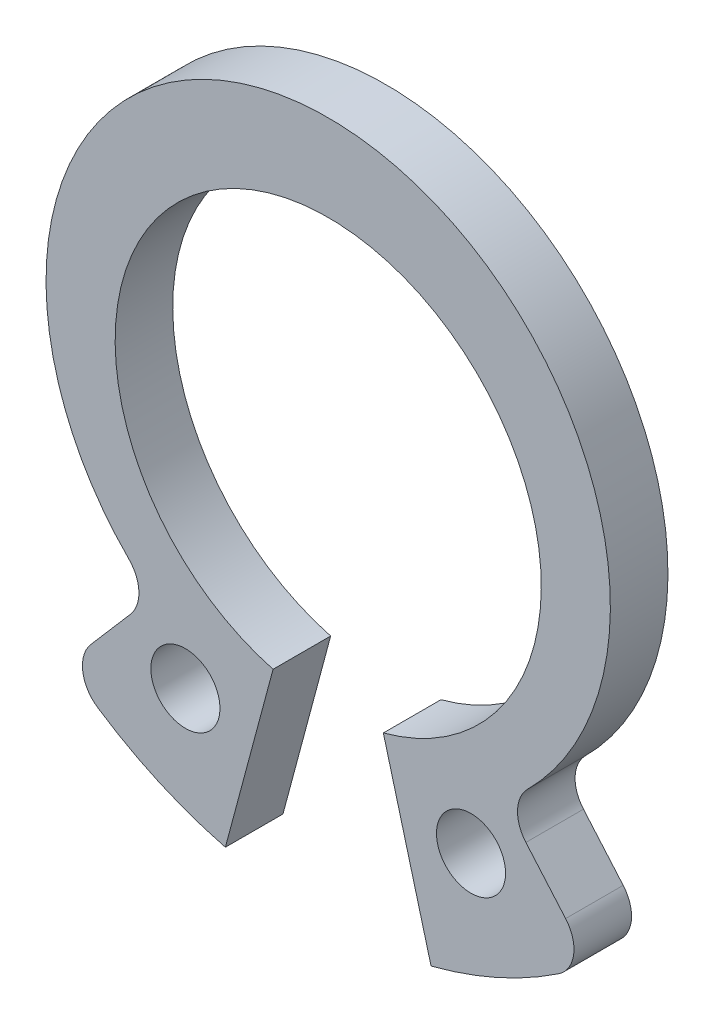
from build123d import *

# Parameters (mm, degrees)
ESQUISSE1_R          = 0.6
BASE_EXTRUSION_DEPTH = 1


with BuildPart() as part:
    # Esquisse1 → Base-Extrusion (new body)
    with BuildSketch(Plane.XY):
        with BuildLine():
            Line((3.432552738, -3.982826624), (4.122496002, -4.783374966))
            ThreePointArc((4.122496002, -4.783374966), (4.262571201, -5.255595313), (4.001948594, -5.673553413))
            ThreePointArc((4.001948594, -5.673553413), (2.93604213, -6.263428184), (1.785851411, -6.664888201))
            Line((1.785851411, -6.664888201), (0.957630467, -3.573925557))
            ThreePointArc((0.957630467, -3.573925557), (0, 3.7), (-0.957630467, -3.573925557))
            Line((-0.957630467, -3.573925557), (-1.785851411, -6.664888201))
            ThreePointArc((-1.785851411, -6.664888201), (-2.93604213, -6.263428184), (-4.001948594, -5.673553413))
            ThreePointArc((-4.001948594, -5.673553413), (-4.262571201, -5.255595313), (-4.122496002, -4.783374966))
            Line((-4.122496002, -4.783374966), (-3.432552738, -3.982826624))
            ThreePointArc((-3.432552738, -3.982826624), (-3.287467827, -3.568749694), (-3.463008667, -3.166636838))
            ThreePointArc((-3.463008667, -3.166636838), (0, 5.2), (3.463008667, -3.166636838))
            ThreePointArc((3.463008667, -3.166636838), (3.287467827, -3.568749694), (3.432552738, -3.982826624))
        make_face()
        with Locations((2.47978953, -4.623739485)):
            Circle(ESQUISSE1_R, mode=Mode.SUBTRACT)
        with Locations(Location((-2.47978953, -4.623739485, 0), (0, 0, 180))):
            Circle(ESQUISSE1_R, mode=Mode.SUBTRACT)
    extrude(amount=BASE_EXTRUSION_DEPTH)


solid = part.part
